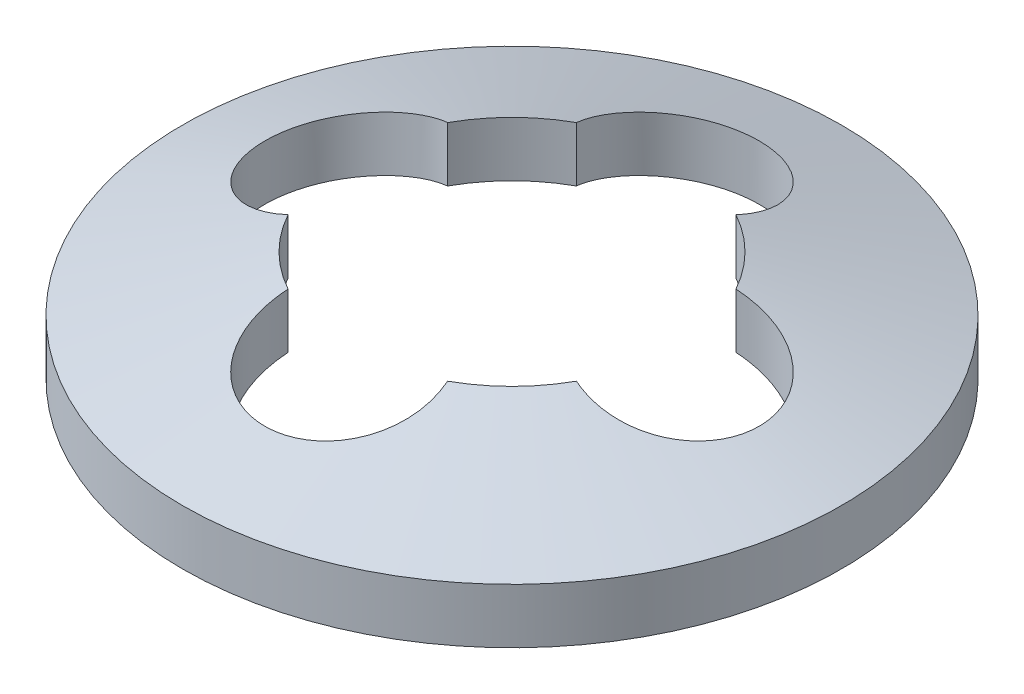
from build123d import *

# Parameters (mm, degrees)
ENL_V_MAT_EXTRU_3_DEPTH = 7.782329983


with BuildPart() as part:
    # Esquisse1 → R_volution1 (revolve)
    with BuildSketch(Plane.XY, mode=Mode.PRIVATE) as r_volution1_sk:
        Polygon((0, 0), (1.5, 0.5), (3, 0.5), (3, 1), (1.5, 1), (0, 0.5), align=None)
    revolve(r_volution1_sk.sketch.rotate(Axis((3, 0.5, 0), (0, 1, 0)), 270), axis=Axis((3, 0.5, 0), (0, 1, 0)))

    # Esquisse3 → Enl_v. mat.-Extru.3 (cut, through all)
    with BuildSketch(Plane(origin=(0, 1, 0), x_dir=(1, 0, 0), z_dir=(0, 1, 0))):
        with BuildLine():
            ThreePointArc((2.273815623, 1.3125), (1.939339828, 1.060660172), (1.6875, 0.726184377))
            ThreePointArc((1.6875, 0.726184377), (0.75, 0), (1.6875, -0.726184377))
            ThreePointArc((1.6875, -0.726184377), (1.939339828, -1.060660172), (2.273815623, -1.3125))
            ThreePointArc((2.273815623, -1.3125), (3, -2.25), (3.726184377, -1.3125))
            ThreePointArc((3.726184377, -1.3125), (4.060660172, -1.060660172), (4.3125, -0.726184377))
            ThreePointArc((4.3125, -0.726184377), (5.25, 0), (4.3125, 0.726184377))
            ThreePointArc((4.3125, 0.726184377), (4.060660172, 1.060660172), (3.726184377, 1.3125))
            ThreePointArc((3.726184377, 1.3125), (3, 2.25), (2.273815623, 1.3125))
        make_face()
    extrude(amount=-ENL_V_MAT_EXTRU_3_DEPTH, mode=Mode.SUBTRACT)


solid = part.part
